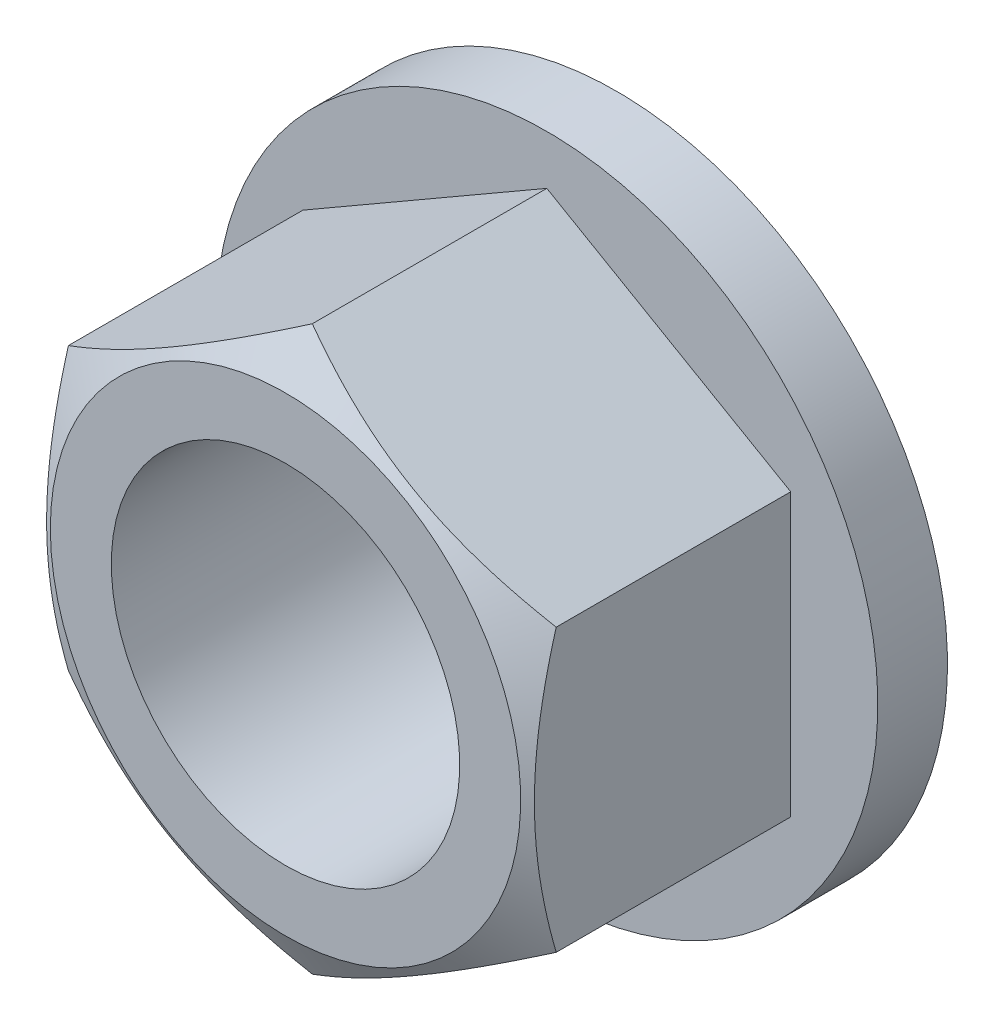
ISO-10303-21;
HEADER;
FILE_DESCRIPTION(('STEP AP214'),'2;1');
FILE_NAME('part.step','',(''),(''),'','','');
FILE_SCHEMA(('AUTOMOTIVE_DESIGN { 1 0 10303 214 1 1 1 1 }'));
ENDSEC;
DATA;
#1=APPLICATION_CONTEXT('core data for automotive mechanical design processes');
#2=APPLICATION_PROTOCOL_DEFINITION('international standard','automotive_design',2000,#1);
#3=PRODUCT_CONTEXT('',#1,'mechanical');
#4=PRODUCT('Part','Part','',(#3));
#5=PRODUCT_RELATED_PRODUCT_CATEGORY('part','',(#4));
#6=PRODUCT_DEFINITION_FORMATION('','',#4);
#7=PRODUCT_DEFINITION_CONTEXT('part definition',#1,'design');
#8=PRODUCT_DEFINITION('design','',#6,#7);
#9=PRODUCT_DEFINITION_SHAPE('','',#8);
#10=(LENGTH_UNIT() NAMED_UNIT(*) SI_UNIT(.MILLI.,.METRE.));
#11=(NAMED_UNIT(*) PLANE_ANGLE_UNIT() SI_UNIT($,.RADIAN.));
#12=(NAMED_UNIT(*) SI_UNIT($,.STERADIAN.) SOLID_ANGLE_UNIT());
#13=UNCERTAINTY_MEASURE_WITH_UNIT(LENGTH_MEASURE(1.E-05),#10,'distance_accuracy_value','');
#14=(GEOMETRIC_REPRESENTATION_CONTEXT(3) GLOBAL_UNCERTAINTY_ASSIGNED_CONTEXT((#13)) GLOBAL_UNIT_ASSIGNED_CONTEXT((#10,
#11,#12)) REPRESENTATION_CONTEXT('',''));
#15=CARTESIAN_POINT('',(0.,0.,0.));
#16=DIRECTION('',(0.,0.,1.));
#17=DIRECTION('',(1.,0.,0.));
#18=AXIS2_PLACEMENT_3D('',#15,#16,#17);
#19=CARTESIAN_POINT('',(0.,8.08290376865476,9.5));
#20=DIRECTION('',(0.5,-0.866025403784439,0.));
#21=DIRECTION('',(0.866025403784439,0.5,0.));
#22=AXIS2_PLACEMENT_3D('',#19,#20,#21);
#23=PLANE('',#22);
#24=DIRECTION('',(0.,0.,-1.));
#25=VECTOR('',#24,1.);
#26=CARTESIAN_POINT('',(-7.,4.04145188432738,9.5));
#27=LINE('',#26,#25);
#28=CARTESIAN_POINT('',(-7.,4.04145188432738,8.73044765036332));
#29=VERTEX_POINT('',#28);
#30=CARTESIAN_POINT('',(-7.,4.04145188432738,2.));
#31=VERTEX_POINT('',#30);
#32=EDGE_CURVE('E9',#29,#31,#27,.T.);
#33=ORIENTED_EDGE('',*,*,#32,.F.);
#34=CARTESIAN_POINT('',(-7.0002,4.04133641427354,8.7303809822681));
#35=CARTESIAN_POINT('',(-6.84633209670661,4.13017208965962,8.78166258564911));
#36=CARTESIAN_POINT('',(-6.69189049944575,4.21933898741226,8.83061683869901));
#37=CARTESIAN_POINT('',(-6.38175307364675,4.39839691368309,8.92322964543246));
#38=CARTESIAN_POINT('',(-6.22605673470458,4.48828823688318,8.96688591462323));
#39=CARTESIAN_POINT('',(-5.75647483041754,4.75940147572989,9.0890508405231));
#40=CARTESIAN_POINT('',(-5.4407356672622,4.94169356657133,9.15853687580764));
#41=CARTESIAN_POINT('',(-4.96823775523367,5.21449036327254,9.2400174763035));
#42=CARTESIAN_POINT('',(-4.81289077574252,5.30417998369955,9.26322894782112));
#43=CARTESIAN_POINT('',(-4.50149488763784,5.48396448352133,9.30215121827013));
#44=CARTESIAN_POINT('',(-4.3454460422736,5.5740593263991,9.31786267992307));
#45=CARTESIAN_POINT('',(-4.03307732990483,5.75440548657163,9.34138451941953));
#46=CARTESIAN_POINT('',(-3.87675797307,5.84465650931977,9.34920386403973));
#47=CARTESIAN_POINT('',(-3.56398349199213,6.02523694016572,9.35678219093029));
#48=CARTESIAN_POINT('',(-3.40752837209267,6.11556634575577,9.3565414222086));
#49=CARTESIAN_POINT('',(-2.97889312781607,6.36303901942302,9.34480270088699));
#50=CARTESIAN_POINT('',(-2.70685331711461,6.52010127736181,9.32509668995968));
#51=CARTESIAN_POINT('',(-2.16458055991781,6.83318259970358,9.26260897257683));
#52=CARTESIAN_POINT('',(-1.89434952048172,6.9892005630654,9.21980590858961));
#53=CARTESIAN_POINT('',(-1.35098545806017,7.30291195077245,9.11281075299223));
#54=CARTESIAN_POINT('',(-1.07792099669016,7.46056579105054,9.04816533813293));
#55=CARTESIAN_POINT('',(-0.535864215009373,7.77352241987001,8.90144636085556));
#56=CARTESIAN_POINT('',(-0.266864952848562,7.92882921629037,8.81940726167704));
#57=CARTESIAN_POINT('',(0.000199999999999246,8.0830192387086,8.7303809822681));
#58=B_SPLINE_CURVE_WITH_KNOTS('',3,(#34,#35,#36,#37,#38,#39,#40,#41,#42,#43,#44,#45,#46,#47,#48,
#49,#50,#51,#52,#53,#54,#55,#56,#57),.UNSPECIFIED.,.F.,.F.,(4,2,2,2,2,2,2,2,2,2,2,4),(0.,
0.554727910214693,1.10969417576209,2.22193274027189,2.76443041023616,3.30688013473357,
3.84871284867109,4.39052882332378,5.33376515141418,6.27787517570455,7.24292418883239,
8.20607866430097),.UNSPECIFIED.);
#59=CARTESIAN_POINT('',(0.,8.08290376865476,8.73044765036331));
#60=VERTEX_POINT('',#59);
#61=EDGE_CURVE('E67',#29,#60,#58,.T.);
#62=ORIENTED_EDGE('',*,*,#61,.T.);
#63=DIRECTION('',(0.,0.,-1.));
#64=VECTOR('',#63,1.);
#65=CARTESIAN_POINT('',(0.,8.08290376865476,9.5));
#66=LINE('',#65,#64);
#67=CARTESIAN_POINT('',(0.,8.08290376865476,2.));
#68=VERTEX_POINT('',#67);
#69=EDGE_CURVE('E74',#60,#68,#66,.T.);
#70=ORIENTED_EDGE('',*,*,#69,.T.);
#71=DIRECTION('',(0.866025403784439,0.5,0.));
#72=VECTOR('',#71,1.);
#73=CARTESIAN_POINT('',(0.,8.08290376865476,2.));
#74=LINE('',#73,#72);
#75=EDGE_CURVE('E109',#31,#68,#74,.T.);
#76=ORIENTED_EDGE('',*,*,#75,.F.);
#77=EDGE_LOOP('',(#33,#62,#70,#76));
#78=FACE_BOUND('',#77,.T.);
#79=ADVANCED_FACE('F14',(#78),#23,.F.);
#80=CARTESIAN_POINT('',(-7.,4.04145188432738,9.5));
#81=DIRECTION('',(1.,0.,0.));
#82=DIRECTION('',(0.,1.,0.));
#83=AXIS2_PLACEMENT_3D('',#80,#81,#82);
#84=PLANE('',#83);
#85=DIRECTION('',(0.,0.,-1.));
#86=VECTOR('',#85,1.);
#87=CARTESIAN_POINT('',(-7.,-4.04145188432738,9.5));
#88=LINE('',#87,#86);
#89=CARTESIAN_POINT('',(-7.,-4.04145188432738,8.73044765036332));
#90=VERTEX_POINT('',#89);
#91=CARTESIAN_POINT('',(-7.,-4.04145188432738,2.));
#92=VERTEX_POINT('',#91);
#93=EDGE_CURVE('E22',#90,#92,#88,.T.);
#94=ORIENTED_EDGE('',*,*,#93,.F.);
#95=CARTESIAN_POINT('',(-7.,-4.04168282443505,8.7303809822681));
#96=CARTESIAN_POINT('',(-7.,-3.86401147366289,8.78166258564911));
#97=CARTESIAN_POINT('',(-7.,-3.68567767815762,8.83061683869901));
#98=CARTESIAN_POINT('',(-7.,-3.32756182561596,8.92322964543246));
#99=CARTESIAN_POINT('',(-7.,-3.14777917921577,8.96688591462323));
#100=CARTESIAN_POINT('',(-7.,-2.60555270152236,9.0890508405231));
#101=CARTESIAN_POINT('',(-7.,-2.24096851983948,9.15853687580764));
#102=CARTESIAN_POINT('',(-7.,-1.69537492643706,9.2400174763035));
#103=CARTESIAN_POINT('',(-7.,-1.51599568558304,9.26322894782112));
#104=CARTESIAN_POINT('',(-7.,-1.15642668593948,9.30215121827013));
#105=CARTESIAN_POINT('',(-7.,-0.976237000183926,9.31786267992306));
#106=CARTESIAN_POINT('',(-7.,-0.61554467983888,9.34138451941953));
#107=CARTESIAN_POINT('',(-7.,-0.435042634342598,9.34920386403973));
#108=CARTESIAN_POINT('',(-7.,-0.0738817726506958,9.35678219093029));
#109=CARTESIAN_POINT('',(-7.,0.106777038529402,9.3565414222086));
#110=CARTESIAN_POINT('',(-7.,0.601722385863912,9.34480270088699));
#111=CARTESIAN_POINT('',(-7.,0.915846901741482,9.32509668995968));
#112=CARTESIAN_POINT('',(-7.,1.54200954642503,9.26260897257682));
#113=CARTESIAN_POINT('',(-7.,1.85404547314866,9.21980590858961));
#114=CARTESIAN_POINT('',(-7.,2.48146824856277,9.11281075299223));
#115=CARTESIAN_POINT('',(-7.,2.79677592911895,9.04816533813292));
#116=CARTESIAN_POINT('',(-7.,3.42268918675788,8.90144636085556));
#117=CARTESIAN_POINT('',(-7.,3.73330277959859,8.81940726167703));
#118=CARTESIAN_POINT('',(-7.,4.04168282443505,8.7303809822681));
#119=B_SPLINE_CURVE_WITH_KNOTS('',3,(#95,#96,#97,#98,#99,#100,#101,#102,#103,#104,#105,#106,
#107,#108,#109,#110,#111,#112,#113,#114,#115,#116,#117,#118),.UNSPECIFIED.,.F.,.F.,(4,2,2,2,2,2,
2,2,2,2,2,4),(0.,0.554727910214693,1.10969417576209,2.22193274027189,2.76443041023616,
3.30688013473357,3.84871284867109,4.39052882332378,5.33376515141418,6.27787517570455,
7.24292418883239,8.20607866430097),.UNSPECIFIED.);
#120=EDGE_CURVE('E77',#90,#29,#119,.T.);
#121=ORIENTED_EDGE('',*,*,#120,.T.);
#122=ORIENTED_EDGE('',*,*,#32,.T.);
#123=DIRECTION('',(0.,1.,0.));
#124=VECTOR('',#123,1.);
#125=CARTESIAN_POINT('',(-7.,4.04145188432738,2.));
#126=LINE('',#125,#124);
#127=EDGE_CURVE('E106',#92,#31,#126,.T.);
#128=ORIENTED_EDGE('',*,*,#127,.F.);
#129=EDGE_LOOP('',(#94,#121,#122,#128));
#130=FACE_BOUND('',#129,.T.);
#131=ADVANCED_FACE('F107',(#130),#84,.F.);
#132=CARTESIAN_POINT('',(-7.,-4.04145188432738,9.5));
#133=DIRECTION('',(0.5,0.866025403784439,0.));
#134=DIRECTION('',(-0.866025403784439,0.5,0.));
#135=AXIS2_PLACEMENT_3D('',#132,#133,#134);
#136=PLANE('',#135);
#137=DIRECTION('',(0.,0.,-1.));
#138=VECTOR('',#137,1.);
#139=CARTESIAN_POINT('',(0.,-8.08290376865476,9.5));
#140=LINE('',#139,#138);
#141=CARTESIAN_POINT('',(0.,-8.08290376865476,8.73044765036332));
#142=VERTEX_POINT('',#141);
#143=CARTESIAN_POINT('',(0.,-8.08290376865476,2.));
#144=VERTEX_POINT('',#143);
#145=EDGE_CURVE('E94',#142,#144,#140,.T.);
#146=ORIENTED_EDGE('',*,*,#145,.F.);
#147=CARTESIAN_POINT('',(5.91338873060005,-11.4970003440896,5.93277279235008));
#148=CARTESIAN_POINT('',(5.64851244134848,-11.3440739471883,6.08119429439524));
#149=CARTESIAN_POINT('',(5.38302939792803,-11.1907972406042,6.22819666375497));
#150=CARTESIAN_POINT('',(4.85052716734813,-10.8833569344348,6.5185652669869));
#151=CARTESIAN_POINT('',(4.58350774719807,-10.7291932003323,6.66193093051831));
#152=CARTESIAN_POINT('',(4.04624011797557,-10.4190015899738,6.94494655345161));
#153=CARTESIAN_POINT('',(3.77598225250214,-10.2629681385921,7.0845721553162));
#154=CARTESIAN_POINT('',(3.23332121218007,-9.94966264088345,7.35812785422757));
#155=CARTESIAN_POINT('',(2.96091813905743,-9.79239065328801,7.49205821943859));
#156=CARTESIAN_POINT('',(2.40469554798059,-9.47125539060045,7.75692873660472));
#157=CARTESIAN_POINT('',(2.12079128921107,-9.30734319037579,7.88763292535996));
#158=CARTESIAN_POINT('',(1.5496663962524,-8.97760407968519,8.13918258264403));
#159=CARTESIAN_POINT('',(1.26244539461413,-8.81177695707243,8.26002694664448));
#160=CARTESIAN_POINT('',(0.684760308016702,-8.47825031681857,8.48869435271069));
#161=CARTESIAN_POINT('',(0.394304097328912,-8.31055534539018,8.59654363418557));
#162=CARTESIAN_POINT('',(-0.190764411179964,-7.97276588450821,8.79577067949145));
#163=CARTESIAN_POINT('',(-0.485375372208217,-7.80267216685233,8.88715361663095));
#164=CARTESIAN_POINT('',(-1.07733232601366,-7.46090566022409,9.04857895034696));
#165=CARTESIAN_POINT('',(-1.37465389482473,-7.28924697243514,9.11873754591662));
#166=CARTESIAN_POINT('',(-1.82335367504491,-7.03019003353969,9.20502687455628));
#167=CARTESIAN_POINT('',(-1.97338426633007,-6.94356983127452,9.23063307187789));
#168=CARTESIAN_POINT('',(-2.27419455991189,-6.76989692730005,9.27502720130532));
#169=CARTESIAN_POINT('',(-2.42497418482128,-6.6828442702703,9.29381582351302));
#170=CARTESIAN_POINT('',(-2.72510641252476,-6.50956284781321,9.32396430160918));
#171=CARTESIAN_POINT('',(-2.87445191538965,-6.42333818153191,9.3354180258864));
#172=CARTESIAN_POINT('',(-3.17342856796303,-6.25072393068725,9.35102199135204));
#173=CARTESIAN_POINT('',(-3.32305971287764,-6.16433434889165,9.35517235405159));
#174=CARTESIAN_POINT('',(-3.62234010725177,-5.99154473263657,9.35607055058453));
#175=CARTESIAN_POINT('',(-3.7719893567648,-5.9051446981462,9.35281836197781));
#176=CARTESIAN_POINT('',(-4.07103579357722,-5.73249015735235,9.33899111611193));
#177=CARTESIAN_POINT('',(-4.22043296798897,-5.64623565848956,9.32841569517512));
#178=CARTESIAN_POINT('',(-4.57911362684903,-5.43915128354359,9.29445858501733));
#179=CARTESIAN_POINT('',(-4.78815726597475,-5.31845988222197,9.26762575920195));
#180=CARTESIAN_POINT('',(-5.20469108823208,-5.07797396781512,9.20108277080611));
#181=CARTESIAN_POINT('',(-5.41218105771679,-4.95817957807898,9.16137086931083));
#182=CARTESIAN_POINT('',(-6.03208416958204,-4.60027834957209,9.02502245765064));
#183=CARTESIAN_POINT('',(-6.44169933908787,-4.36378692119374,8.91119802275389));
#184=CARTESIAN_POINT('',(-7.05420318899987,-4.01015765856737,8.71383765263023));
#185=CARTESIAN_POINT('',(-7.2602692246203,-3.89118537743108,8.64269353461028));
#186=CARTESIAN_POINT('',(-7.67039981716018,-3.65439636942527,8.4930210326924));
#187=CARTESIAN_POINT('',(-7.87446436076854,-3.53657965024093,8.41449259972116));
#188=CARTESIAN_POINT('',(-8.28065627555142,-3.30206463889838,8.25131104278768));
#189=CARTESIAN_POINT('',(-8.48278426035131,-3.18536599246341,8.16665993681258));
#190=CARTESIAN_POINT('',(-8.8853657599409,-2.9529354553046,7.99222855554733));
#191=CARTESIAN_POINT('',(-9.08581929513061,-2.83720355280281,7.90244834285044));
#192=CARTESIAN_POINT('',(-9.56202536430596,-2.56226585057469,7.68326832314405));
#193=CARTESIAN_POINT('',(-9.83709935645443,-2.4034518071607,7.55190638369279));
#194=CARTESIAN_POINT('',(-10.3848824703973,-2.08718907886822,7.28274582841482));
#195=CARTESIAN_POINT('',(-10.6575914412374,-1.92974048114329,7.14494680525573));
#196=CARTESIAN_POINT('',(-11.2010843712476,-1.61595469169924,6.86421681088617));
#197=CARTESIAN_POINT('',(-11.4718679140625,-1.45961774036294,6.72128476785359));
#198=CARTESIAN_POINT('',(-12.0117886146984,-1.14789437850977,6.43132564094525));
#199=CARTESIAN_POINT('',(-12.2809257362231,-0.992507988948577,6.28429846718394));
#200=CARTESIAN_POINT('',(-12.8181148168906,-0.682361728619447,5.98676447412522));
#201=CARTESIAN_POINT('',(-13.0861652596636,-0.52760273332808,5.83625401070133));
#202=CARTESIAN_POINT('',(-13.6211053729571,-0.218754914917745,5.53250483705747));
#203=CARTESIAN_POINT('',(-13.8879950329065,-0.0646660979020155,5.3792661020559));
#204=CARTESIAN_POINT('',(-14.6871290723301,0.396714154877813,4.9162314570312));
#205=CARTESIAN_POINT('',(-15.2179130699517,0.703162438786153,4.60307546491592));
#206=CARTESIAN_POINT('',(-16.231639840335,1.28843786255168,3.99737911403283));
#207=CARTESIAN_POINT('',(-16.7148127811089,1.56739788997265,3.70535007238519));
#208=CARTESIAN_POINT('',(-17.6793686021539,2.12428445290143,3.11733020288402));
#209=CARTESIAN_POINT('',(-18.1607514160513,2.40221095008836,2.82133922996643));
#210=CARTESIAN_POINT('',(-19.1208972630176,2.95655141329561,2.22710312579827));
#211=CARTESIAN_POINT('',(-19.5996638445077,3.23296742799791,1.92886562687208));
#212=CARTESIAN_POINT('',(-20.5560545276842,3.78513984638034,1.3300310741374));
#213=CARTESIAN_POINT('',(-21.0336786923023,4.06089628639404,1.0294341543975));
#214=CARTESIAN_POINT('',(-21.5108834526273,4.33641058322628,0.727958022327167));
#215=B_SPLINE_CURVE_WITH_KNOTS('',3,(#147,#148,#149,#150,#151,#152,#153,#154,#155,#156,#157,
#158,#159,#160,#161,#162,#163,#164,#165,#166,#167,#168,#169,#170,#171,#172,#173,#174,#175,#176,
#177,#178,#179,#180,#181,#182,#183,#184,#185,#186,#187,#188,#189,#190,#191,#192,#193,#194,#195,
#196,#197,#198,#199,#200,#201,#202,#203,#204,#205,#206,#207,#208,#209,#210,#211,#212,#213,#214),
.UNSPECIFIED.,.F.,.F.,(4,2,2,2,2,2,2,2,2,2,2,2,2,2,2,2,2,2,2,2,2,2,2,2,2,2,2,2,2,2,2,2,2,4),(0.,
1.01990152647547,2.03996202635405,3.06555258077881,4.09109479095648,5.14973126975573,
6.20848617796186,7.26506611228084,8.32131351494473,9.37166892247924,9.89692361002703,
10.4221251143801,10.940463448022,11.4587931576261,11.9771244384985,12.4954814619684,
13.2236791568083,13.9519752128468,15.4093679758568,16.1543640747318,16.8993651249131,
17.6441217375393,18.38886926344,19.4199335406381,20.4510631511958,21.4824093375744,
22.5137781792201,23.5462797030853,24.5787906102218,26.6435255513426,28.5326888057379,
30.4219214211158,32.3063568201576,34.190685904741),.UNSPECIFIED.);
#216=EDGE_CURVE('E104',#142,#90,#215,.T.);
#217=ORIENTED_EDGE('',*,*,#216,.T.);
#218=ORIENTED_EDGE('',*,*,#93,.T.);
#219=DIRECTION('',(-0.866025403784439,0.5,0.));
#220=VECTOR('',#219,1.);
#221=CARTESIAN_POINT('',(-7.,-4.04145188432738,2.));
#222=LINE('',#221,#220);
#223=EDGE_CURVE('E102',#144,#92,#222,.T.);
#224=ORIENTED_EDGE('',*,*,#223,.F.);
#225=EDGE_LOOP('',(#146,#217,#218,#224));
#226=FACE_BOUND('',#225,.T.);
#227=ADVANCED_FACE('F100',(#226),#136,.F.);
#228=CARTESIAN_POINT('',(0.,-8.08290376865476,9.5));
#229=DIRECTION('',(-0.5,0.866025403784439,0.));
#230=DIRECTION('',(-0.866025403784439,-0.5,0.));
#231=AXIS2_PLACEMENT_3D('',#228,#229,#230);
#232=PLANE('',#231);
#233=DIRECTION('',(0.,0.,-1.));
#234=VECTOR('',#233,1.);
#235=CARTESIAN_POINT('',(7.,-4.04145188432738,9.5));
#236=LINE('',#235,#234);
#237=CARTESIAN_POINT('',(7.,-4.04145188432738,8.73044765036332));
#238=VERTEX_POINT('',#237);
#239=CARTESIAN_POINT('',(7.,-4.04145188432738,2.));
#240=VERTEX_POINT('',#239);
#241=EDGE_CURVE('E86',#238,#240,#236,.T.);
#242=ORIENTED_EDGE('',*,*,#241,.F.);
#243=CARTESIAN_POINT('',(7.0002,-4.04133641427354,8.7303809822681));
#244=CARTESIAN_POINT('',(6.84633209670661,-4.13017208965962,8.78166258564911));
#245=CARTESIAN_POINT('',(6.69189049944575,-4.21933898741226,8.83061683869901));
#246=CARTESIAN_POINT('',(6.38175307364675,-4.39839691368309,8.92322964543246));
#247=CARTESIAN_POINT('',(6.22605673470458,-4.48828823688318,8.96688591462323));
#248=CARTESIAN_POINT('',(5.75647483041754,-4.75940147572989,9.0890508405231));
#249=CARTESIAN_POINT('',(5.4407356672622,-4.94169356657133,9.15853687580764));
#250=CARTESIAN_POINT('',(4.96823775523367,-5.21449036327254,9.2400174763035));
#251=CARTESIAN_POINT('',(4.81289077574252,-5.30417998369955,9.26322894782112));
#252=CARTESIAN_POINT('',(4.50149488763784,-5.48396448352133,9.30215121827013));
#253=CARTESIAN_POINT('',(4.3454460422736,-5.5740593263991,9.31786267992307));
#254=CARTESIAN_POINT('',(4.03307732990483,-5.75440548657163,9.34138451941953));
#255=CARTESIAN_POINT('',(3.87675797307,-5.84465650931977,9.34920386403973));
#256=CARTESIAN_POINT('',(3.56398349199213,-6.02523694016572,9.35678219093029));
#257=CARTESIAN_POINT('',(3.40752837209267,-6.11556634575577,9.3565414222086));
#258=CARTESIAN_POINT('',(2.97889312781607,-6.36303901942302,9.34480270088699));
#259=CARTESIAN_POINT('',(2.70685331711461,-6.52010127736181,9.32509668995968));
#260=CARTESIAN_POINT('',(2.16458055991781,-6.83318259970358,9.26260897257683));
#261=CARTESIAN_POINT('',(1.89434952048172,-6.9892005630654,9.21980590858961));
#262=CARTESIAN_POINT('',(1.35098545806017,-7.30291195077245,9.11281075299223));
#263=CARTESIAN_POINT('',(1.07792099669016,-7.46056579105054,9.04816533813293));
#264=CARTESIAN_POINT('',(0.535864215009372,-7.77352241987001,8.90144636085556));
#265=CARTESIAN_POINT('',(0.266864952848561,-7.92882921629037,8.81940726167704));
#266=CARTESIAN_POINT('',(-0.000200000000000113,-8.0830192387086,8.7303809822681));
#267=B_SPLINE_CURVE_WITH_KNOTS('',3,(#243,#244,#245,#246,#247,#248,#249,#250,#251,#252,#253,
#254,#255,#256,#257,#258,#259,#260,#261,#262,#263,#264,#265,#266),.UNSPECIFIED.,.F.,.F.,(4,2,2,
2,2,2,2,2,2,2,2,4),(0.,0.554727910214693,1.10969417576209,2.22193274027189,2.76443041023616,
3.30688013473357,3.84871284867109,4.39052882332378,5.33376515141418,6.27787517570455,
7.2429241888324,8.20607866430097),.UNSPECIFIED.);
#268=EDGE_CURVE('E199',#238,#142,#267,.T.);
#269=ORIENTED_EDGE('',*,*,#268,.T.);
#270=ORIENTED_EDGE('',*,*,#145,.T.);
#271=DIRECTION('',(-0.866025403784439,-0.5,0.));
#272=VECTOR('',#271,1.);
#273=CARTESIAN_POINT('',(0.,-8.08290376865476,2.));
#274=LINE('',#273,#272);
#275=EDGE_CURVE('E114',#240,#144,#274,.T.);
#276=ORIENTED_EDGE('',*,*,#275,.F.);
#277=EDGE_LOOP('',(#242,#269,#270,#276));
#278=FACE_BOUND('',#277,.T.);
#279=ADVANCED_FACE('F155',(#278),#232,.F.);
#280=CARTESIAN_POINT('',(7.,-4.04145188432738,9.5));
#281=DIRECTION('',(-1.,0.,0.));
#282=DIRECTION('',(0.,-1.,0.));
#283=AXIS2_PLACEMENT_3D('',#280,#281,#282);
#284=PLANE('',#283);
#285=DIRECTION('',(0.,0.,-1.));
#286=VECTOR('',#285,1.);
#287=CARTESIAN_POINT('',(7.,4.04145188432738,9.5));
#288=LINE('',#287,#286);
#289=CARTESIAN_POINT('',(7.,4.04145188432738,8.73044765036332));
#290=VERTEX_POINT('',#289);
#291=CARTESIAN_POINT('',(7.,4.04145188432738,2.));
#292=VERTEX_POINT('',#291);
#293=EDGE_CURVE('E83',#290,#292,#288,.T.);
#294=ORIENTED_EDGE('',*,*,#293,.F.);
#295=CARTESIAN_POINT('',(7.,4.04168282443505,8.7303809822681));
#296=CARTESIAN_POINT('',(7.,3.86401147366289,8.78166258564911));
#297=CARTESIAN_POINT('',(7.,3.68567767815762,8.83061683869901));
#298=CARTESIAN_POINT('',(7.,3.32756182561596,8.92322964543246));
#299=CARTESIAN_POINT('',(7.,3.14777917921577,8.96688591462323));
#300=CARTESIAN_POINT('',(7.,2.60555270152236,9.0890508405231));
#301=CARTESIAN_POINT('',(7.,2.24096851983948,9.15853687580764));
#302=CARTESIAN_POINT('',(7.,1.69537492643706,9.2400174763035));
#303=CARTESIAN_POINT('',(7.,1.51599568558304,9.26322894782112));
#304=CARTESIAN_POINT('',(7.,1.15642668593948,9.30215121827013));
#305=CARTESIAN_POINT('',(7.,0.976237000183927,9.31786267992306));
#306=CARTESIAN_POINT('',(7.,0.615544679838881,9.34138451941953));
#307=CARTESIAN_POINT('',(7.,0.435042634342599,9.34920386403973));
#308=CARTESIAN_POINT('',(7.,0.0738817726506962,9.35678219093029));
#309=CARTESIAN_POINT('',(7.,-0.106777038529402,9.3565414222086));
#310=CARTESIAN_POINT('',(7.,-0.601722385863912,9.34480270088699));
#311=CARTESIAN_POINT('',(7.,-0.915846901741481,9.32509668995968));
#312=CARTESIAN_POINT('',(7.,-1.54200954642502,9.26260897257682));
#313=CARTESIAN_POINT('',(7.,-1.85404547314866,9.21980590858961));
#314=CARTESIAN_POINT('',(7.,-2.48146824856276,9.11281075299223));
#315=CARTESIAN_POINT('',(7.,-2.79677592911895,9.04816533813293));
#316=CARTESIAN_POINT('',(7.,-3.42268918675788,8.90144636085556));
#317=CARTESIAN_POINT('',(7.,-3.73330277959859,8.81940726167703));
#318=CARTESIAN_POINT('',(7.,-4.04168282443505,8.7303809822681));
#319=B_SPLINE_CURVE_WITH_KNOTS('',3,(#295,#296,#297,#298,#299,#300,#301,#302,#303,#304,#305,
#306,#307,#308,#309,#310,#311,#312,#313,#314,#315,#316,#317,#318),.UNSPECIFIED.,.F.,.F.,(4,2,2,
2,2,2,2,2,2,2,2,4),(0.,0.554727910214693,1.10969417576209,2.22193274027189,2.76443041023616,
3.30688013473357,3.84871284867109,4.39052882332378,5.33376515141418,6.27787517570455,
7.24292418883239,8.20607866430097),.UNSPECIFIED.);
#320=EDGE_CURVE('E29',#290,#238,#319,.T.);
#321=ORIENTED_EDGE('',*,*,#320,.T.);
#322=ORIENTED_EDGE('',*,*,#241,.T.);
#323=DIRECTION('',(0.,-1.,0.));
#324=VECTOR('',#323,1.);
#325=CARTESIAN_POINT('',(7.,-4.04145188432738,2.));
#326=LINE('',#325,#324);
#327=EDGE_CURVE('E116',#292,#240,#326,.T.);
#328=ORIENTED_EDGE('',*,*,#327,.F.);
#329=EDGE_LOOP('',(#294,#321,#322,#328));
#330=FACE_BOUND('',#329,.T.);
#331=ADVANCED_FACE('F143',(#330),#284,.F.);
#332=CARTESIAN_POINT('',(7.,4.04145188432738,9.5));
#333=DIRECTION('',(-0.5,-0.866025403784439,0.));
#334=DIRECTION('',(0.866025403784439,-0.5,0.));
#335=AXIS2_PLACEMENT_3D('',#332,#333,#334);
#336=PLANE('',#335);
#337=ORIENTED_EDGE('',*,*,#69,.F.);
#338=CARTESIAN_POINT('',(12.9133887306,0.627355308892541,5.93277279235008));
#339=CARTESIAN_POINT('',(12.6485124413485,0.780281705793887,6.08119429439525));
#340=CARTESIAN_POINT('',(12.383029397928,0.933558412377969,6.22819666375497));
#341=CARTESIAN_POINT('',(11.8505271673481,1.24099871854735,6.5185652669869));
#342=CARTESIAN_POINT('',(11.5835077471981,1.39516245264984,6.66193093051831));
#343=CARTESIAN_POINT('',(11.0462401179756,1.70535406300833,6.94494655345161));
#344=CARTESIAN_POINT('',(10.7759822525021,1.86138751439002,7.0845721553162));
#345=CARTESIAN_POINT('',(10.2333212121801,2.17469301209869,7.35812785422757));
#346=CARTESIAN_POINT('',(9.96091813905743,2.33196499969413,7.49205821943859));
#347=CARTESIAN_POINT('',(9.40469554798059,2.65310026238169,7.75692873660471));
#348=CARTESIAN_POINT('',(9.12079128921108,2.81701246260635,7.88763292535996));
#349=CARTESIAN_POINT('',(8.5496663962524,3.14675157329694,8.13918258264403));
#350=CARTESIAN_POINT('',(8.26244539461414,3.3125786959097,8.26002694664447));
#351=CARTESIAN_POINT('',(7.68476030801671,3.64610533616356,8.48869435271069));
#352=CARTESIAN_POINT('',(7.39430409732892,3.81380030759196,8.59654363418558));
#353=CARTESIAN_POINT('',(6.80923558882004,4.15158976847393,8.79577067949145));
#354=CARTESIAN_POINT('',(6.51462462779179,4.32168348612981,8.88715361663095));
#355=CARTESIAN_POINT('',(5.92266767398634,4.66344999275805,9.04857895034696));
#356=CARTESIAN_POINT('',(5.62534610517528,4.835108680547,9.11873754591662));
#357=CARTESIAN_POINT('',(5.1766463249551,5.09416561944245,9.20502687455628));
#358=CARTESIAN_POINT('',(5.02661573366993,5.18078582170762,9.23063307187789));
#359=CARTESIAN_POINT('',(4.72580544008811,5.35445872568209,9.27502720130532));
#360=CARTESIAN_POINT('',(4.57502581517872,5.44151138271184,9.29381582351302));
#361=CARTESIAN_POINT('',(4.27489358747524,5.61479280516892,9.32396430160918));
#362=CARTESIAN_POINT('',(4.12554808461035,5.70101747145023,9.3354180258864));
#363=CARTESIAN_POINT('',(3.82657143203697,5.87363172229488,9.35102199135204));
#364=CARTESIAN_POINT('',(3.67694028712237,5.96002130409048,9.35517235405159));
#365=CARTESIAN_POINT('',(3.37765989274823,6.13281092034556,9.35607055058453));
#366=CARTESIAN_POINT('',(3.2280106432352,6.21921095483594,9.35281836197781));
#367=CARTESIAN_POINT('',(2.92896420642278,6.39186549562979,9.33899111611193));
#368=CARTESIAN_POINT('',(2.77956703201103,6.47811999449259,9.32841569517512));
#369=CARTESIAN_POINT('',(2.42088637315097,6.68520436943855,9.29445858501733));
#370=CARTESIAN_POINT('',(2.21184273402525,6.80589577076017,9.26762575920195));
#371=CARTESIAN_POINT('',(1.79530891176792,7.04638168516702,9.20108277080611));
#372=CARTESIAN_POINT('',(1.5878189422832,7.16617607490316,9.16137086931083));
#373=CARTESIAN_POINT('',(0.967915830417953,7.52407730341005,9.02502245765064));
#374=CARTESIAN_POINT('',(0.558300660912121,7.7605687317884,8.91119802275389));
#375=CARTESIAN_POINT('',(-0.0542031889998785,8.11419799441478,8.71383765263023));
#376=CARTESIAN_POINT('',(-0.260269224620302,8.23317027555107,8.64269353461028));
#377=CARTESIAN_POINT('',(-0.670399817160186,8.46995928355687,8.4930210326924));
#378=CARTESIAN_POINT('',(-0.87446436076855,8.58777600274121,8.41449259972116));
#379=CARTESIAN_POINT('',(-1.28065627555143,8.82229101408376,8.25131104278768));
#380=CARTESIAN_POINT('',(-1.48278426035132,8.93898966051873,8.16665993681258));
#381=CARTESIAN_POINT('',(-1.88536575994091,9.17142019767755,7.99222855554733));
#382=CARTESIAN_POINT('',(-2.08581929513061,9.28715210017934,7.90244834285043));
#383=CARTESIAN_POINT('',(-2.56202536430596,9.56208980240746,7.68326832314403));
#384=CARTESIAN_POINT('',(-2.83709935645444,9.72090384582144,7.55190638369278));
#385=CARTESIAN_POINT('',(-3.38488247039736,10.0371665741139,7.28274582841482));
#386=CARTESIAN_POINT('',(-3.65759144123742,10.1946151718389,7.14494680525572));
#387=CARTESIAN_POINT('',(-4.20108437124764,10.5084009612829,6.86421681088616));
#388=CARTESIAN_POINT('',(-4.47186791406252,10.6647379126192,6.72128476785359));
#389=CARTESIAN_POINT('',(-5.01178861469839,10.9764612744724,6.43132564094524));
#390=CARTESIAN_POINT('',(-5.28092573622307,11.1318476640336,6.28429846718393));
#391=CARTESIAN_POINT('',(-5.81811481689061,11.4419939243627,5.98676447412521));
#392=CARTESIAN_POINT('',(-6.08616525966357,11.5967529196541,5.83625401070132));
#393=CARTESIAN_POINT('',(-6.62110537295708,11.9056007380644,5.53250483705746));
#394=CARTESIAN_POINT('',(-6.88799503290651,12.0596895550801,5.37926610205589));
#395=CARTESIAN_POINT('',(-7.68712907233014,12.52106980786,4.91623145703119));
#396=CARTESIAN_POINT('',(-8.21791306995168,12.8275180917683,4.60307546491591));
#397=CARTESIAN_POINT('',(-9.23163984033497,13.4127935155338,3.99737911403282));
#398=CARTESIAN_POINT('',(-9.7148127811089,13.6917535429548,3.70535007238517));
#399=CARTESIAN_POINT('',(-10.679368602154,14.2486401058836,3.11733020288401));
#400=CARTESIAN_POINT('',(-11.1607514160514,14.5265666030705,2.82133922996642));
#401=CARTESIAN_POINT('',(-12.1208972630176,15.0809070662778,2.22710312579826));
#402=CARTESIAN_POINT('',(-12.5996638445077,15.3573230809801,1.92886562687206));
#403=CARTESIAN_POINT('',(-13.5560545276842,15.9094954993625,1.33003107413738));
#404=CARTESIAN_POINT('',(-14.0336786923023,16.1852519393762,1.02943415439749));
#405=CARTESIAN_POINT('',(-14.5108834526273,16.4607662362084,0.727958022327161));
#406=B_SPLINE_CURVE_WITH_KNOTS('',3,(#338,#339,#340,#341,#342,#343,#344,#345,#346,#347,#348,
#349,#350,#351,#352,#353,#354,#355,#356,#357,#358,#359,#360,#361,#362,#363,#364,#365,#366,#367,
#368,#369,#370,#371,#372,#373,#374,#375,#376,#377,#378,#379,#380,#381,#382,#383,#384,#385,#386,
#387,#388,#389,#390,#391,#392,#393,#394,#395,#396,#397,#398,#399,#400,#401,#402,#403,#404,#405),
.UNSPECIFIED.,.F.,.F.,(4,2,2,2,2,2,2,2,2,2,2,2,2,2,2,2,2,2,2,2,2,2,2,2,2,2,2,2,2,2,2,2,2,4),(0.,
1.01990152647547,2.03996202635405,3.0655525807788,4.09109479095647,5.14973126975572,
6.20848617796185,7.26506611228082,8.32131351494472,9.37166892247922,9.89692361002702,
10.4221251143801,10.940463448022,11.4587931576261,11.9771244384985,12.4954814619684,
13.2236791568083,13.9519752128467,15.4093679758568,16.1543640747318,16.8993651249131,
17.6441217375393,18.38886926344,19.4199335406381,20.4510631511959,21.4824093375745,
22.5137781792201,23.5462797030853,24.5787906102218,26.6435255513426,28.5326888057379,
30.4219214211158,32.3063568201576,34.190685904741),.UNSPECIFIED.);
#407=EDGE_CURVE('E64',#60,#290,#406,.F.);
#408=ORIENTED_EDGE('',*,*,#407,.T.);
#409=ORIENTED_EDGE('',*,*,#293,.T.);
#410=DIRECTION('',(0.866025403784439,-0.5,0.));
#411=VECTOR('',#410,1.);
#412=CARTESIAN_POINT('',(7.,4.04145188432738,2.));
#413=LINE('',#412,#411);
#414=EDGE_CURVE('E81',#68,#292,#413,.T.);
#415=ORIENTED_EDGE('',*,*,#414,.F.);
#416=EDGE_LOOP('',(#337,#408,#409,#415));
#417=FACE_BOUND('',#416,.T.);
#418=ADVANCED_FACE('F79',(#417),#336,.F.);
#419=CARTESIAN_POINT('',(-7.,4.04145188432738,9.5));
#420=DIRECTION('',(0.,0.,1.));
#421=DIRECTION('',(-0.866025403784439,0.5,0.));
#422=AXIS2_PLACEMENT_3D('',#419,#420,#421);
#423=PLANE('',#422);
#424=CARTESIAN_POINT('',(0.,0.,9.5));
#425=DIRECTION('',(0.,0.,-1.));
#426=DIRECTION('',(0.866025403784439,-0.5,0.));
#427=AXIS2_PLACEMENT_3D('',#424,#425,#426);
#428=CIRCLE('',#427,6.75);
#429=CARTESIAN_POINT('',(5.84567147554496,-3.375,9.5));
#430=VERTEX_POINT('',#429);
#431=EDGE_CURVE('E71',#430,#430,#428,.T.);
#432=ORIENTED_EDGE('',*,*,#431,.F.);
#433=EDGE_LOOP('',(#432));
#434=FACE_BOUND('',#433,.T.);
#435=CARTESIAN_POINT('',(0.,0.,9.5));
#436=DIRECTION('',(0.,0.,1.));
#437=DIRECTION('',(-0.866025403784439,0.5,0.));
#438=AXIS2_PLACEMENT_3D('',#435,#436,#437);
#439=CIRCLE('',#438,5.);
#440=CARTESIAN_POINT('',(-4.3301270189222,2.5,9.5));
#441=VERTEX_POINT('',#440);
#442=EDGE_CURVE('E84',#441,#441,#439,.T.);
#443=ORIENTED_EDGE('',*,*,#442,.F.);
#444=EDGE_LOOP('',(#443));
#445=FACE_BOUND('',#444,.T.);
#446=ADVANCED_FACE('F132',(#434,#445),#423,.T.);
#447=CARTESIAN_POINT('',(-7.,4.04145188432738,0.));
#448=DIRECTION('',(0.,0.,1.));
#449=DIRECTION('',(-0.866025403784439,0.5,0.));
#450=AXIS2_PLACEMENT_3D('',#447,#448,#449);
#451=PLANE('',#450);
#452=CARTESIAN_POINT('',(0.,0.,0.));
#453=DIRECTION('',(0.,0.,1.));
#454=DIRECTION('',(-0.866025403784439,0.5,0.));
#455=AXIS2_PLACEMENT_3D('',#452,#453,#454);
#456=CIRCLE('',#455,5.);
#457=CARTESIAN_POINT('',(-4.3301270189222,2.5,0.));
#458=VERTEX_POINT('',#457);
#459=EDGE_CURVE('E89',#458,#458,#456,.T.);
#460=ORIENTED_EDGE('',*,*,#459,.T.);
#461=EDGE_LOOP('',(#460));
#462=FACE_BOUND('',#461,.T.);
#463=CARTESIAN_POINT('',(0.,0.,0.));
#464=DIRECTION('',(0.,0.,-1.));
#465=DIRECTION('',(0.866025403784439,-0.5,0.));
#466=AXIS2_PLACEMENT_3D('',#463,#464,#465);
#467=CIRCLE('',#466,9.5);
#468=CARTESIAN_POINT('',(8.22724133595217,-4.75,0.));
#469=VERTEX_POINT('',#468);
#470=EDGE_CURVE('E76',#469,#469,#467,.T.);
#471=ORIENTED_EDGE('',*,*,#470,.T.);
#472=EDGE_LOOP('',(#471));
#473=FACE_BOUND('',#472,.T.);
#474=ADVANCED_FACE('F123',(#462,#473),#451,.F.);
#475=CARTESIAN_POINT('',(0.,0.,9.5));
#476=DIRECTION('',(0.,0.,-1.));
#477=DIRECTION('',(0.866025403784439,-0.5,0.));
#478=AXIS2_PLACEMENT_3D('',#475,#476,#477);
#479=CYLINDRICAL_SURFACE('',#478,5.);
#480=ORIENTED_EDGE('',*,*,#459,.F.);
#481=EDGE_LOOP('',(#480));
#482=FACE_BOUND('',#481,.T.);
#483=ORIENTED_EDGE('',*,*,#442,.T.);
#484=EDGE_LOOP('',(#483));
#485=FACE_BOUND('',#484,.T.);
#486=ADVANCED_FACE('F126',(#482,#485),#479,.F.);
#487=CARTESIAN_POINT('',(0.,0.,2.));
#488=DIRECTION('',(0.,0.,-1.));
#489=DIRECTION('',(0.866025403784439,-0.5,0.));
#490=AXIS2_PLACEMENT_3D('',#487,#488,#489);
#491=PLANE('',#490);
#492=CARTESIAN_POINT('',(0.,0.,2.));
#493=DIRECTION('',(0.,0.,-1.));
#494=DIRECTION('',(0.866025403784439,-0.5,0.));
#495=AXIS2_PLACEMENT_3D('',#492,#493,#494);
#496=CIRCLE('',#495,9.5);
#497=CARTESIAN_POINT('',(8.22724133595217,-4.75,2.));
#498=VERTEX_POINT('',#497);
#499=EDGE_CURVE('E217',#498,#498,#496,.T.);
#500=ORIENTED_EDGE('',*,*,#499,.F.);
#501=EDGE_LOOP('',(#500));
#502=FACE_BOUND('',#501,.T.);
#503=ORIENTED_EDGE('',*,*,#127,.T.);
#504=ORIENTED_EDGE('',*,*,#75,.T.);
#505=ORIENTED_EDGE('',*,*,#414,.T.);
#506=ORIENTED_EDGE('',*,*,#327,.T.);
#507=ORIENTED_EDGE('',*,*,#275,.T.);
#508=ORIENTED_EDGE('',*,*,#223,.T.);
#509=EDGE_LOOP('',(#503,#504,#505,#506,#507,#508));
#510=FACE_BOUND('',#509,.T.);
#511=ADVANCED_FACE('F111',(#502,#510),#491,.F.);
#512=CARTESIAN_POINT('',(0.,0.,2.));
#513=DIRECTION('',(0.,0.,-1.));
#514=DIRECTION('',(0.866025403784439,-0.5,0.));
#515=AXIS2_PLACEMENT_3D('',#512,#513,#514);
#516=CYLINDRICAL_SURFACE('',#515,9.5);
#517=ORIENTED_EDGE('',*,*,#499,.T.);
#518=EDGE_LOOP('',(#517));
#519=FACE_BOUND('',#518,.T.);
#520=ORIENTED_EDGE('',*,*,#470,.F.);
#521=EDGE_LOOP('',(#520));
#522=FACE_BOUND('',#521,.T.);
#523=ADVANCED_FACE('F180',(#519,#522),#516,.T.);
#524=CARTESIAN_POINT('',(0.,0.,9.5));
#525=DIRECTION('',(0.,0.,-1.));
#526=DIRECTION('',(0.866025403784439,-0.5,0.));
#527=AXIS2_PLACEMENT_3D('',#524,#525,#526);
#528=CONICAL_SURFACE('',#527,6.75,1.0471975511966);
#529=ORIENTED_EDGE('',*,*,#431,.T.);
#530=EDGE_LOOP('',(#529));
#531=FACE_BOUND('',#530,.T.);
#532=ORIENTED_EDGE('',*,*,#120,.F.);
#533=ORIENTED_EDGE('',*,*,#216,.F.);
#534=ORIENTED_EDGE('',*,*,#268,.F.);
#535=ORIENTED_EDGE('',*,*,#320,.F.);
#536=ORIENTED_EDGE('',*,*,#407,.F.);
#537=ORIENTED_EDGE('',*,*,#61,.F.);
#538=EDGE_LOOP('',(#532,#533,#534,#535,#536,#537));
#539=FACE_BOUND('',#538,.T.);
#540=ADVANCED_FACE('F66',(#531,#539),#528,.T.);
#541=CLOSED_SHELL('',(#79,#131,#227,#279,#331,#418,#446,#474,#486,#511,#523,#540));
#542=MANIFOLD_SOLID_BREP('B1',#541);
#543=ADVANCED_BREP_SHAPE_REPRESENTATION('',(#18,#542),#14);
#544=SHAPE_DEFINITION_REPRESENTATION(#9,#543);
ENDSEC;
END-ISO-10303-21;
